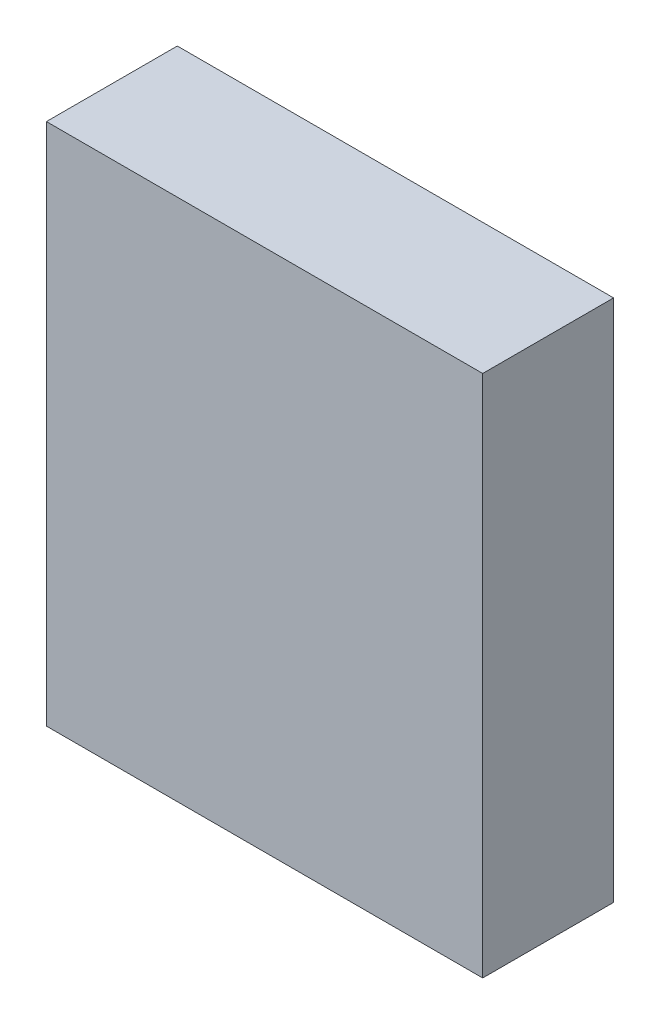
ISO-10303-21;
HEADER;
FILE_DESCRIPTION(('STEP AP214'),'2;1');
FILE_NAME('part.step','',(''),(''),'','','');
FILE_SCHEMA(('AUTOMOTIVE_DESIGN { 1 0 10303 214 1 1 1 1 }'));
ENDSEC;
DATA;
#1=APPLICATION_CONTEXT('core data for automotive mechanical design processes');
#2=APPLICATION_PROTOCOL_DEFINITION('international standard','automotive_design',2000,#1);
#3=PRODUCT_CONTEXT('',#1,'mechanical');
#4=PRODUCT('Part','Part','',(#3));
#5=PRODUCT_RELATED_PRODUCT_CATEGORY('part','',(#4));
#6=PRODUCT_DEFINITION_FORMATION('','',#4);
#7=PRODUCT_DEFINITION_CONTEXT('part definition',#1,'design');
#8=PRODUCT_DEFINITION('design','',#6,#7);
#9=PRODUCT_DEFINITION_SHAPE('','',#8);
#10=(LENGTH_UNIT() NAMED_UNIT(*) SI_UNIT(.MILLI.,.METRE.));
#11=(NAMED_UNIT(*) PLANE_ANGLE_UNIT() SI_UNIT($,.RADIAN.));
#12=(NAMED_UNIT(*) SI_UNIT($,.STERADIAN.) SOLID_ANGLE_UNIT());
#13=UNCERTAINTY_MEASURE_WITH_UNIT(LENGTH_MEASURE(1.E-05),#10,'distance_accuracy_value','');
#14=(GEOMETRIC_REPRESENTATION_CONTEXT(3) GLOBAL_UNCERTAINTY_ASSIGNED_CONTEXT((#13)) GLOBAL_UNIT_ASSIGNED_CONTEXT((#10,
#11,#12)) REPRESENTATION_CONTEXT('',''));
#15=CARTESIAN_POINT('',(0.,0.,0.));
#16=DIRECTION('',(0.,0.,1.));
#17=DIRECTION('',(1.,0.,0.));
#18=AXIS2_PLACEMENT_3D('',#15,#16,#17);
#19=CARTESIAN_POINT('',(-25.,60.,-10.));
#20=DIRECTION('',(1.,0.,0.));
#21=DIRECTION('',(0.,0.,-1.));
#22=AXIS2_PLACEMENT_3D('',#19,#20,#21);
#23=PLANE('',#22);
#24=DIRECTION('',(0.,0.,1.));
#25=VECTOR('',#24,1.);
#26=CARTESIAN_POINT('',(-25.,0.,-10.));
#27=LINE('',#26,#25);
#28=CARTESIAN_POINT('',(-25.,0.,-10.));
#29=VERTEX_POINT('',#28);
#30=CARTESIAN_POINT('',(-25.,0.,5.));
#31=VERTEX_POINT('',#30);
#32=EDGE_CURVE('E94',#29,#31,#27,.T.);
#33=ORIENTED_EDGE('',*,*,#32,.T.);
#34=DIRECTION('',(0.,-1.,0.));
#35=VECTOR('',#34,1.);
#36=CARTESIAN_POINT('',(-25.,60.,5.));
#37=LINE('',#36,#35);
#38=CARTESIAN_POINT('',(-25.,60.,5.));
#39=VERTEX_POINT('',#38);
#40=EDGE_CURVE('E11',#39,#31,#37,.T.);
#41=ORIENTED_EDGE('',*,*,#40,.F.);
#42=DIRECTION('',(0.,0.,1.));
#43=VECTOR('',#42,1.);
#44=CARTESIAN_POINT('',(-25.,60.,-10.));
#45=LINE('',#44,#43);
#46=CARTESIAN_POINT('',(-25.,60.,-10.));
#47=VERTEX_POINT('',#46);
#48=EDGE_CURVE('E82',#47,#39,#45,.T.);
#49=ORIENTED_EDGE('',*,*,#48,.F.);
#50=DIRECTION('',(0.,-1.,0.));
#51=VECTOR('',#50,1.);
#52=CARTESIAN_POINT('',(-25.,60.,-10.));
#53=LINE('',#52,#51);
#54=EDGE_CURVE('E90',#47,#29,#53,.T.);
#55=ORIENTED_EDGE('',*,*,#54,.T.);
#56=EDGE_LOOP('',(#33,#41,#49,#55));
#57=FACE_BOUND('',#56,.T.);
#58=ADVANCED_FACE('F31',(#57),#23,.F.);
#59=CARTESIAN_POINT('',(-25.,60.,5.));
#60=DIRECTION('',(0.,0.,-1.));
#61=DIRECTION('',(-1.,0.,0.));
#62=AXIS2_PLACEMENT_3D('',#59,#60,#61);
#63=PLANE('',#62);
#64=DIRECTION('',(1.,0.,0.));
#65=VECTOR('',#64,1.);
#66=CARTESIAN_POINT('',(-25.,0.,5.));
#67=LINE('',#66,#65);
#68=CARTESIAN_POINT('',(25.,0.,5.));
#69=VERTEX_POINT('',#68);
#70=EDGE_CURVE('E86',#31,#69,#67,.T.);
#71=ORIENTED_EDGE('',*,*,#70,.T.);
#72=DIRECTION('',(0.,-1.,0.));
#73=VECTOR('',#72,1.);
#74=CARTESIAN_POINT('',(25.,60.,5.));
#75=LINE('',#74,#73);
#76=CARTESIAN_POINT('',(25.,60.,5.));
#77=VERTEX_POINT('',#76);
#78=EDGE_CURVE('E39',#77,#69,#75,.T.);
#79=ORIENTED_EDGE('',*,*,#78,.F.);
#80=DIRECTION('',(1.,0.,0.));
#81=VECTOR('',#80,1.);
#82=CARTESIAN_POINT('',(-25.,60.,5.));
#83=LINE('',#82,#81);
#84=EDGE_CURVE('E77',#39,#77,#83,.T.);
#85=ORIENTED_EDGE('',*,*,#84,.F.);
#86=ORIENTED_EDGE('',*,*,#40,.T.);
#87=EDGE_LOOP('',(#71,#79,#85,#86));
#88=FACE_BOUND('',#87,.T.);
#89=ADVANCED_FACE('F85',(#88),#63,.F.);
#90=CARTESIAN_POINT('',(25.,60.,-10.));
#91=DIRECTION('',(-1.,0.,0.));
#92=DIRECTION('',(0.,0.,1.));
#93=AXIS2_PLACEMENT_3D('',#90,#91,#92);
#94=PLANE('',#93);
#95=DIRECTION('',(0.,0.,-1.));
#96=VECTOR('',#95,1.);
#97=CARTESIAN_POINT('',(25.,0.,-10.));
#98=LINE('',#97,#96);
#99=CARTESIAN_POINT('',(25.,0.,-10.));
#100=VERTEX_POINT('',#99);
#101=EDGE_CURVE('E64',#69,#100,#98,.T.);
#102=ORIENTED_EDGE('',*,*,#101,.T.);
#103=DIRECTION('',(0.,-1.,0.));
#104=VECTOR('',#103,1.);
#105=CARTESIAN_POINT('',(25.,60.,-10.));
#106=LINE('',#105,#104);
#107=CARTESIAN_POINT('',(25.,60.,-10.));
#108=VERTEX_POINT('',#107);
#109=EDGE_CURVE('E87',#108,#100,#106,.T.);
#110=ORIENTED_EDGE('',*,*,#109,.F.);
#111=DIRECTION('',(0.,0.,-1.));
#112=VECTOR('',#111,1.);
#113=CARTESIAN_POINT('',(25.,60.,-10.));
#114=LINE('',#113,#112);
#115=EDGE_CURVE('E80',#77,#108,#114,.T.);
#116=ORIENTED_EDGE('',*,*,#115,.F.);
#117=ORIENTED_EDGE('',*,*,#78,.T.);
#118=EDGE_LOOP('',(#102,#110,#116,#117));
#119=FACE_BOUND('',#118,.T.);
#120=ADVANCED_FACE('F88',(#119),#94,.F.);
#121=CARTESIAN_POINT('',(-25.,60.,-10.));
#122=DIRECTION('',(0.,0.,1.));
#123=DIRECTION('',(1.,0.,0.));
#124=AXIS2_PLACEMENT_3D('',#121,#122,#123);
#125=PLANE('',#124);
#126=DIRECTION('',(-1.,0.,0.));
#127=VECTOR('',#126,1.);
#128=CARTESIAN_POINT('',(-25.,0.,-10.));
#129=LINE('',#128,#127);
#130=EDGE_CURVE('E70',#100,#29,#129,.T.);
#131=ORIENTED_EDGE('',*,*,#130,.T.);
#132=ORIENTED_EDGE('',*,*,#54,.F.);
#133=DIRECTION('',(-1.,0.,0.));
#134=VECTOR('',#133,1.);
#135=CARTESIAN_POINT('',(-25.,60.,-10.));
#136=LINE('',#135,#134);
#137=EDGE_CURVE('E47',#108,#47,#136,.T.);
#138=ORIENTED_EDGE('',*,*,#137,.F.);
#139=ORIENTED_EDGE('',*,*,#109,.T.);
#140=EDGE_LOOP('',(#131,#132,#138,#139));
#141=FACE_BOUND('',#140,.T.);
#142=ADVANCED_FACE('F101',(#141),#125,.F.);
#143=CARTESIAN_POINT('',(-25.,60.,5.));
#144=DIRECTION('',(0.,1.,0.));
#145=DIRECTION('',(0.,0.,1.));
#146=AXIS2_PLACEMENT_3D('',#143,#144,#145);
#147=PLANE('',#146);
#148=ORIENTED_EDGE('',*,*,#48,.T.);
#149=ORIENTED_EDGE('',*,*,#84,.T.);
#150=ORIENTED_EDGE('',*,*,#115,.T.);
#151=ORIENTED_EDGE('',*,*,#137,.T.);
#152=EDGE_LOOP('',(#148,#149,#150,#151));
#153=FACE_BOUND('',#152,.T.);
#154=ADVANCED_FACE('F78',(#153),#147,.T.);
#155=CARTESIAN_POINT('',(-25.,0.,5.));
#156=DIRECTION('',(0.,1.,0.));
#157=DIRECTION('',(0.,0.,1.));
#158=AXIS2_PLACEMENT_3D('',#155,#156,#157);
#159=PLANE('',#158);
#160=ORIENTED_EDGE('',*,*,#32,.F.);
#161=ORIENTED_EDGE('',*,*,#130,.F.);
#162=ORIENTED_EDGE('',*,*,#101,.F.);
#163=ORIENTED_EDGE('',*,*,#70,.F.);
#164=EDGE_LOOP('',(#160,#161,#162,#163));
#165=FACE_BOUND('',#164,.T.);
#166=ADVANCED_FACE('F104',(#165),#159,.F.);
#167=CLOSED_SHELL('',(#58,#89,#120,#142,#154,#166));
#168=MANIFOLD_SOLID_BREP('B2',#167);
#169=ADVANCED_BREP_SHAPE_REPRESENTATION('',(#18,#168),#14);
#170=SHAPE_DEFINITION_REPRESENTATION(#9,#169);
ENDSEC;
END-ISO-10303-21;
